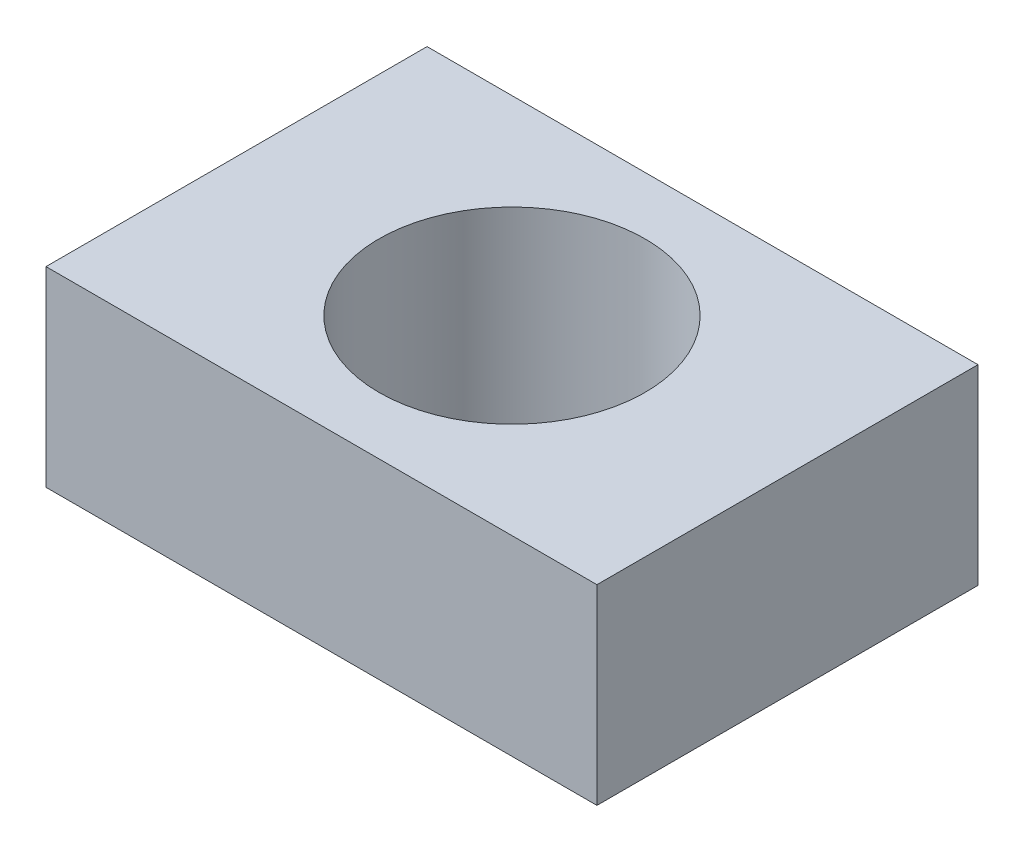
from build123d import *

# Parameters (mm, degrees)
SKETCH1_W           = 167.14929742
SKETCH1_H           = 115.610793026
SKETCH1_R           = 40.365848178
BOSS_EXTRUDE1_DEPTH = 58


with BuildPart() as part:
    # Sketch1 → Boss-Extrude1 (new body)
    with BuildSketch(Plane(origin=(0, 0, 0), x_dir=(1, 0, 0), z_dir=(0, 1, 0))):
        Rectangle(SKETCH1_W, SKETCH1_H)
        with Locations(Location((0, 0, 0), (0, 0, 270))):
            Circle(SKETCH1_R, mode=Mode.SUBTRACT)
    extrude(amount=BOSS_EXTRUDE1_DEPTH)


solid = part.part
